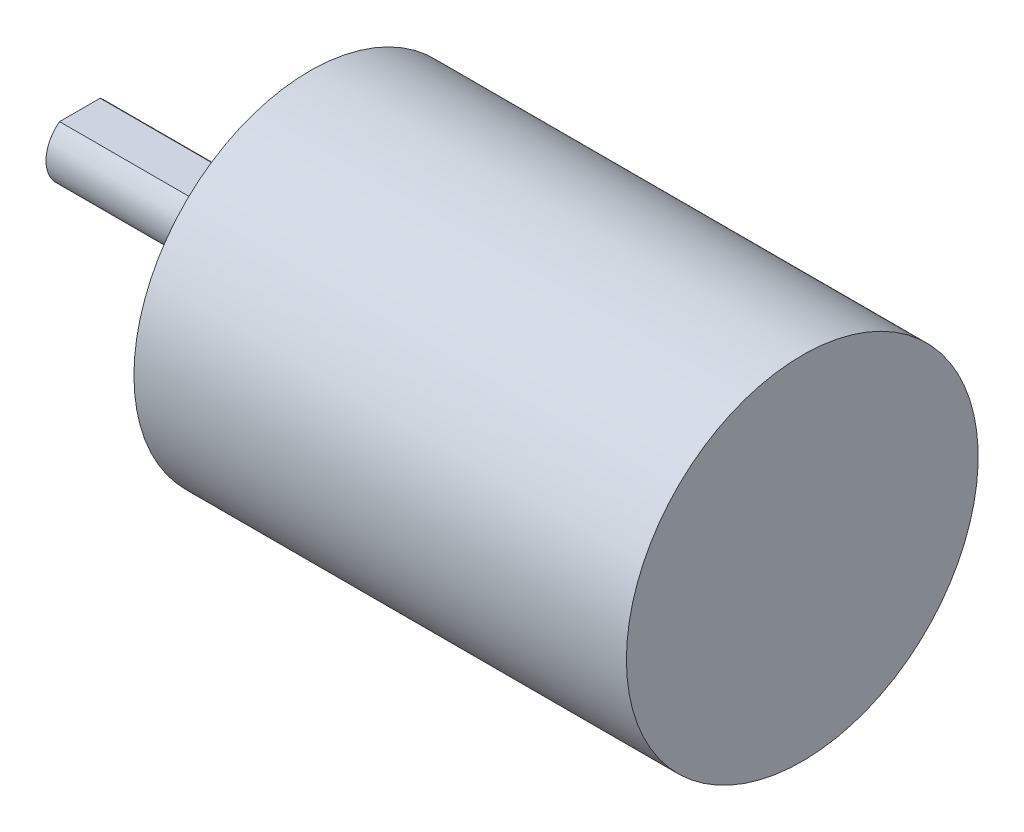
ISO-10303-21;
HEADER;
FILE_DESCRIPTION(('STEP AP214'),'2;1');
FILE_NAME('part.step','',(''),(''),'','','');
FILE_SCHEMA(('AUTOMOTIVE_DESIGN { 1 0 10303 214 1 1 1 1 }'));
ENDSEC;
DATA;
#1=APPLICATION_CONTEXT('core data for automotive mechanical design processes');
#2=APPLICATION_PROTOCOL_DEFINITION('international standard','automotive_design',2000,#1);
#3=PRODUCT_CONTEXT('',#1,'mechanical');
#4=PRODUCT('Part','Part','',(#3));
#5=PRODUCT_RELATED_PRODUCT_CATEGORY('part','',(#4));
#6=PRODUCT_DEFINITION_FORMATION('','',#4);
#7=PRODUCT_DEFINITION_CONTEXT('part definition',#1,'design');
#8=PRODUCT_DEFINITION('design','',#6,#7);
#9=PRODUCT_DEFINITION_SHAPE('','',#8);
#10=(LENGTH_UNIT() NAMED_UNIT(*) SI_UNIT(.MILLI.,.METRE.));
#11=(NAMED_UNIT(*) PLANE_ANGLE_UNIT() SI_UNIT($,.RADIAN.));
#12=(NAMED_UNIT(*) SI_UNIT($,.STERADIAN.) SOLID_ANGLE_UNIT());
#13=UNCERTAINTY_MEASURE_WITH_UNIT(LENGTH_MEASURE(1.E-05),#10,'distance_accuracy_value','');
#14=(GEOMETRIC_REPRESENTATION_CONTEXT(3) GLOBAL_UNCERTAINTY_ASSIGNED_CONTEXT((#13)) GLOBAL_UNIT_ASSIGNED_CONTEXT((#10,
#11,#12)) REPRESENTATION_CONTEXT('',''));
#15=CARTESIAN_POINT('',(0.,0.,0.));
#16=DIRECTION('',(0.,0.,1.));
#17=DIRECTION('',(1.,0.,0.));
#18=AXIS2_PLACEMENT_3D('',#15,#16,#17);
#19=CARTESIAN_POINT('',(53.4,13.,0.));
#20=DIRECTION('',(-1.,0.,0.));
#21=DIRECTION('',(0.,0.,1.));
#22=AXIS2_PLACEMENT_3D('',#19,#20,#21);
#23=PLANE('',#22);
#24=CARTESIAN_POINT('',(53.4,0.,0.));
#25=DIRECTION('',(-1.,0.,0.));
#26=DIRECTION('',(0.,0.,1.));
#27=AXIS2_PLACEMENT_3D('',#24,#25,#26);
#28=CIRCLE('',#27,13.);
#29=CARTESIAN_POINT('',(53.4,0.,13.));
#30=VERTEX_POINT('',#29);
#31=EDGE_CURVE('E11',#30,#30,#28,.T.);
#32=ORIENTED_EDGE('',*,*,#31,.F.);
#33=EDGE_LOOP('',(#32));
#34=FACE_BOUND('',#33,.T.);
#35=ADVANCED_FACE('F42',(#34),#23,.F.);
#36=CARTESIAN_POINT('',(0.,0.,0.));
#37=DIRECTION('',(-1.,0.,0.));
#38=DIRECTION('',(0.,0.,1.));
#39=AXIS2_PLACEMENT_3D('',#36,#37,#38);
#40=CYLINDRICAL_SURFACE('',#39,13.);
#41=CARTESIAN_POINT('',(17.,0.,0.));
#42=DIRECTION('',(-1.,0.,0.));
#43=DIRECTION('',(0.,0.,1.));
#44=AXIS2_PLACEMENT_3D('',#41,#42,#43);
#45=CIRCLE('',#44,13.);
#46=CARTESIAN_POINT('',(17.,0.,13.));
#47=VERTEX_POINT('',#46);
#48=EDGE_CURVE('E49',#47,#47,#45,.T.);
#49=ORIENTED_EDGE('',*,*,#48,.F.);
#50=EDGE_LOOP('',(#49));
#51=FACE_BOUND('',#50,.T.);
#52=ORIENTED_EDGE('',*,*,#31,.T.);
#53=EDGE_LOOP('',(#52));
#54=FACE_BOUND('',#53,.T.);
#55=ADVANCED_FACE('F154',(#51,#54),#40,.T.);
#56=CARTESIAN_POINT('',(17.,6.5,0.));
#57=DIRECTION('',(1.,0.,0.));
#58=DIRECTION('',(0.,0.,-1.));
#59=AXIS2_PLACEMENT_3D('',#56,#57,#58);
#60=PLANE('',#59);
#61=CARTESIAN_POINT('',(17.,-10.,1.04744500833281E-13));
#62=DIRECTION('',(-1.,0.,0.));
#63=DIRECTION('',(0.,0.,1.));
#64=AXIS2_PLACEMENT_3D('',#61,#62,#63);
#65=CIRCLE('',#64,1.5);
#66=CARTESIAN_POINT('',(17.,-10.,1.5000000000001));
#67=VERTEX_POINT('',#66);
#68=EDGE_CURVE('E92',#67,#67,#65,.T.);
#69=ORIENTED_EDGE('',*,*,#68,.F.);
#70=EDGE_LOOP('',(#69));
#71=FACE_BOUND('',#70,.T.);
#72=CARTESIAN_POINT('',(17.,0.,-10.));
#73=DIRECTION('',(-1.,0.,0.));
#74=DIRECTION('',(0.,0.,1.));
#75=AXIS2_PLACEMENT_3D('',#72,#73,#74);
#76=CIRCLE('',#75,1.5);
#77=CARTESIAN_POINT('',(17.,0.,-8.5));
#78=VERTEX_POINT('',#77);
#79=EDGE_CURVE('E103',#78,#78,#76,.T.);
#80=ORIENTED_EDGE('',*,*,#79,.F.);
#81=EDGE_LOOP('',(#80));
#82=FACE_BOUND('',#81,.T.);
#83=CARTESIAN_POINT('',(17.,10.,0.));
#84=DIRECTION('',(-1.,0.,0.));
#85=DIRECTION('',(0.,0.,1.));
#86=AXIS2_PLACEMENT_3D('',#83,#84,#85);
#87=CIRCLE('',#86,1.5);
#88=CARTESIAN_POINT('',(17.,10.,1.49999999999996));
#89=VERTEX_POINT('',#88);
#90=EDGE_CURVE('E112',#89,#89,#87,.T.);
#91=ORIENTED_EDGE('',*,*,#90,.F.);
#92=EDGE_LOOP('',(#91));
#93=FACE_BOUND('',#92,.T.);
#94=CARTESIAN_POINT('',(17.,0.,10.));
#95=DIRECTION('',(-1.,0.,0.));
#96=DIRECTION('',(0.,0.,1.));
#97=AXIS2_PLACEMENT_3D('',#94,#95,#96);
#98=CIRCLE('',#97,1.5);
#99=CARTESIAN_POINT('',(17.,0.,11.5));
#100=VERTEX_POINT('',#99);
#101=EDGE_CURVE('E121',#100,#100,#98,.T.);
#102=ORIENTED_EDGE('',*,*,#101,.F.);
#103=EDGE_LOOP('',(#102));
#104=FACE_BOUND('',#103,.T.);
#105=CARTESIAN_POINT('',(17.,0.,0.));
#106=DIRECTION('',(-1.,0.,0.));
#107=DIRECTION('',(0.,0.,1.));
#108=AXIS2_PLACEMENT_3D('',#105,#106,#107);
#109=CIRCLE('',#108,6.5);
#110=CARTESIAN_POINT('',(17.,0.,6.5));
#111=VERTEX_POINT('',#110);
#112=EDGE_CURVE('E147',#111,#111,#109,.T.);
#113=ORIENTED_EDGE('',*,*,#112,.F.);
#114=EDGE_LOOP('',(#113));
#115=FACE_BOUND('',#114,.T.);
#116=ORIENTED_EDGE('',*,*,#48,.T.);
#117=EDGE_LOOP('',(#116));
#118=FACE_BOUND('',#117,.T.);
#119=ADVANCED_FACE('F152',(#71,#82,#93,#104,#115,#118),#60,.F.);
#120=CARTESIAN_POINT('',(0.,0.,0.));
#121=DIRECTION('',(-1.,0.,0.));
#122=DIRECTION('',(0.,0.,1.));
#123=AXIS2_PLACEMENT_3D('',#120,#121,#122);
#124=CYLINDRICAL_SURFACE('',#123,6.5);
#125=CARTESIAN_POINT('',(15.,0.,0.));
#126=DIRECTION('',(-1.,0.,0.));
#127=DIRECTION('',(0.,0.,1.));
#128=AXIS2_PLACEMENT_3D('',#125,#126,#127);
#129=CIRCLE('',#128,6.5);
#130=CARTESIAN_POINT('',(15.,0.,6.5));
#131=VERTEX_POINT('',#130);
#132=EDGE_CURVE('E144',#131,#131,#129,.T.);
#133=ORIENTED_EDGE('',*,*,#132,.F.);
#134=EDGE_LOOP('',(#133));
#135=FACE_BOUND('',#134,.T.);
#136=ORIENTED_EDGE('',*,*,#112,.T.);
#137=EDGE_LOOP('',(#136));
#138=FACE_BOUND('',#137,.T.);
#139=ADVANCED_FACE('F173',(#135,#138),#124,.T.);
#140=CARTESIAN_POINT('',(15.,3.,0.));
#141=DIRECTION('',(1.,0.,0.));
#142=DIRECTION('',(0.,0.,-1.));
#143=AXIS2_PLACEMENT_3D('',#140,#141,#142);
#144=PLANE('',#143);
#145=CARTESIAN_POINT('',(15.,0.,0.));
#146=DIRECTION('',(-1.,0.,0.));
#147=DIRECTION('',(0.,0.,1.));
#148=AXIS2_PLACEMENT_3D('',#145,#146,#147);
#149=CIRCLE('',#148,3.);
#150=CARTESIAN_POINT('',(15.,0.,3.));
#151=VERTEX_POINT('',#150);
#152=EDGE_CURVE('E141',#151,#151,#149,.T.);
#153=ORIENTED_EDGE('',*,*,#152,.F.);
#154=EDGE_LOOP('',(#153));
#155=FACE_BOUND('',#154,.T.);
#156=ORIENTED_EDGE('',*,*,#132,.T.);
#157=EDGE_LOOP('',(#156));
#158=FACE_BOUND('',#157,.T.);
#159=ADVANCED_FACE('F182',(#155,#158),#144,.F.);
#160=CARTESIAN_POINT('',(0.,0.,0.));
#161=DIRECTION('',(-1.,0.,0.));
#162=DIRECTION('',(0.,0.,1.));
#163=AXIS2_PLACEMENT_3D('',#160,#161,#162);
#164=CYLINDRICAL_SURFACE('',#163,3.);
#165=CARTESIAN_POINT('',(14.5,0.,0.));
#166=DIRECTION('',(-1.,0.,0.));
#167=DIRECTION('',(0.,0.,1.));
#168=AXIS2_PLACEMENT_3D('',#165,#166,#167);
#169=CIRCLE('',#168,3.);
#170=CARTESIAN_POINT('',(14.5,0.,3.));
#171=VERTEX_POINT('',#170);
#172=EDGE_CURVE('E138',#171,#171,#169,.T.);
#173=ORIENTED_EDGE('',*,*,#172,.F.);
#174=EDGE_LOOP('',(#173));
#175=FACE_BOUND('',#174,.T.);
#176=ORIENTED_EDGE('',*,*,#152,.T.);
#177=EDGE_LOOP('',(#176));
#178=FACE_BOUND('',#177,.T.);
#179=ADVANCED_FACE('F190',(#175,#178),#164,.T.);
#180=CARTESIAN_POINT('',(14.5,2.5,0.));
#181=DIRECTION('',(1.,0.,0.));
#182=DIRECTION('',(0.,0.,-1.));
#183=AXIS2_PLACEMENT_3D('',#180,#181,#182);
#184=PLANE('',#183);
#185=CARTESIAN_POINT('',(14.5,0.,0.));
#186=DIRECTION('',(-1.,0.,0.));
#187=DIRECTION('',(0.,0.,1.));
#188=AXIS2_PLACEMENT_3D('',#185,#186,#187);
#189=CIRCLE('',#188,2.5);
#190=CARTESIAN_POINT('',(14.5,0.,2.5));
#191=VERTEX_POINT('',#190);
#192=EDGE_CURVE('E135',#191,#191,#189,.T.);
#193=ORIENTED_EDGE('',*,*,#192,.F.);
#194=EDGE_LOOP('',(#193));
#195=FACE_BOUND('',#194,.T.);
#196=ORIENTED_EDGE('',*,*,#172,.T.);
#197=EDGE_LOOP('',(#196));
#198=FACE_BOUND('',#197,.T.);
#199=ADVANCED_FACE('F198',(#195,#198),#184,.F.);
#200=CARTESIAN_POINT('',(0.,0.,0.));
#201=DIRECTION('',(-1.,0.,0.));
#202=DIRECTION('',(0.,0.,1.));
#203=AXIS2_PLACEMENT_3D('',#200,#201,#202);
#204=CYLINDRICAL_SURFACE('',#203,2.5);
#205=CARTESIAN_POINT('',(12.,0.,0.));
#206=DIRECTION('',(-1.,0.,0.));
#207=DIRECTION('',(0.,0.,1.));
#208=AXIS2_PLACEMENT_3D('',#205,#206,#207);
#209=CIRCLE('',#208,2.5);
#210=CARTESIAN_POINT('',(12.,2.,1.5));
#211=VERTEX_POINT('',#210);
#212=CARTESIAN_POINT('',(12.,2.,-1.5));
#213=VERTEX_POINT('',#212);
#214=EDGE_CURVE('E126',#211,#213,#209,.T.);
#215=ORIENTED_EDGE('',*,*,#214,.F.);
#216=DIRECTION('',(-1.,0.,0.));
#217=VECTOR('',#216,1.);
#218=CARTESIAN_POINT('',(12.,2.,1.5));
#219=LINE('',#218,#217);
#220=CARTESIAN_POINT('',(0.,2.,1.5));
#221=VERTEX_POINT('',#220);
#222=EDGE_CURVE('E61',#211,#221,#219,.T.);
#223=ORIENTED_EDGE('',*,*,#222,.T.);
#224=CARTESIAN_POINT('',(0.,0.,0.));
#225=DIRECTION('',(-1.,0.,0.));
#226=DIRECTION('',(0.,0.,1.));
#227=AXIS2_PLACEMENT_3D('',#224,#225,#226);
#228=CIRCLE('',#227,2.5);
#229=CARTESIAN_POINT('',(0.,2.,-1.5));
#230=VERTEX_POINT('',#229);
#231=EDGE_CURVE('E131',#230,#221,#228,.T.);
#232=ORIENTED_EDGE('',*,*,#231,.F.);
#233=DIRECTION('',(-1.,0.,0.));
#234=VECTOR('',#233,1.);
#235=CARTESIAN_POINT('',(12.,2.,-1.5));
#236=LINE('',#235,#234);
#237=EDGE_CURVE('E56',#213,#230,#236,.T.);
#238=ORIENTED_EDGE('',*,*,#237,.F.);
#239=EDGE_LOOP('',(#215,#223,#232,#238));
#240=FACE_BOUND('',#239,.T.);
#241=ORIENTED_EDGE('',*,*,#192,.T.);
#242=EDGE_LOOP('',(#241));
#243=FACE_BOUND('',#242,.T.);
#244=ADVANCED_FACE('F206',(#240,#243),#204,.T.);
#245=CARTESIAN_POINT('',(0.,0.,0.));
#246=DIRECTION('',(1.,0.,0.));
#247=DIRECTION('',(0.,0.,-1.));
#248=AXIS2_PLACEMENT_3D('',#245,#246,#247);
#249=PLANE('',#248);
#250=ORIENTED_EDGE('',*,*,#231,.T.);
#251=DIRECTION('',(0.,0.,1.));
#252=VECTOR('',#251,1.);
#253=CARTESIAN_POINT('',(0.,2.,-1.5));
#254=LINE('',#253,#252);
#255=EDGE_CURVE('E124',#230,#221,#254,.T.);
#256=ORIENTED_EDGE('',*,*,#255,.F.);
#257=EDGE_LOOP('',(#250,#256));
#258=FACE_BOUND('',#257,.T.);
#259=ADVANCED_FACE('F214',(#258),#249,.F.);
#260=CARTESIAN_POINT('',(12.,2.,-1.5));
#261=DIRECTION('',(0.,-1.,0.));
#262=DIRECTION('',(0.,0.,-1.));
#263=AXIS2_PLACEMENT_3D('',#260,#261,#262);
#264=PLANE('',#263);
#265=ORIENTED_EDGE('',*,*,#255,.T.);
#266=ORIENTED_EDGE('',*,*,#222,.F.);
#267=DIRECTION('',(0.,0.,1.));
#268=VECTOR('',#267,1.);
#269=CARTESIAN_POINT('',(12.,2.,-1.5));
#270=LINE('',#269,#268);
#271=EDGE_CURVE('E128',#213,#211,#270,.T.);
#272=ORIENTED_EDGE('',*,*,#271,.F.);
#273=ORIENTED_EDGE('',*,*,#237,.T.);
#274=EDGE_LOOP('',(#265,#266,#272,#273));
#275=FACE_BOUND('',#274,.T.);
#276=ADVANCED_FACE('F222',(#275),#264,.F.);
#277=CARTESIAN_POINT('',(12.,0.,0.));
#278=DIRECTION('',(-1.,0.,0.));
#279=DIRECTION('',(0.,0.,1.));
#280=AXIS2_PLACEMENT_3D('',#277,#278,#279);
#281=PLANE('',#280);
#282=ORIENTED_EDGE('',*,*,#214,.T.);
#283=ORIENTED_EDGE('',*,*,#271,.T.);
#284=EDGE_LOOP('',(#282,#283));
#285=FACE_BOUND('',#284,.T.);
#286=ADVANCED_FACE('F230',(#285),#281,.T.);
#287=CARTESIAN_POINT('',(17.,0.,10.));
#288=DIRECTION('',(-1.,0.,0.));
#289=DIRECTION('',(0.,0.,1.));
#290=AXIS2_PLACEMENT_3D('',#287,#288,#289);
#291=CONICAL_SURFACE('',#290,1.5,0.785398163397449);
#292=CARTESIAN_POINT('',(17.25,0.,10.));
#293=DIRECTION('',(-1.,0.,0.));
#294=DIRECTION('',(0.,0.,1.));
#295=AXIS2_PLACEMENT_3D('',#292,#293,#294);
#296=CIRCLE('',#295,1.25);
#297=CARTESIAN_POINT('',(17.25,0.,11.25));
#298=VERTEX_POINT('',#297);
#299=EDGE_CURVE('E118',#298,#298,#296,.T.);
#300=ORIENTED_EDGE('',*,*,#299,.F.);
#301=EDGE_LOOP('',(#300));
#302=FACE_BOUND('',#301,.T.);
#303=ORIENTED_EDGE('',*,*,#101,.T.);
#304=EDGE_LOOP('',(#303));
#305=FACE_BOUND('',#304,.T.);
#306=ADVANCED_FACE('F237',(#302,#305),#291,.F.);
#307=CARTESIAN_POINT('',(17.,0.,10.));
#308=DIRECTION('',(-1.,0.,0.));
#309=DIRECTION('',(0.,0.,1.));
#310=AXIS2_PLACEMENT_3D('',#307,#308,#309);
#311=CYLINDRICAL_SURFACE('',#310,1.25);
#312=CARTESIAN_POINT('',(22.5,0.,10.));
#313=DIRECTION('',(-1.,0.,0.));
#314=DIRECTION('',(0.,0.,1.));
#315=AXIS2_PLACEMENT_3D('',#312,#313,#314);
#316=CIRCLE('',#315,1.25);
#317=CARTESIAN_POINT('',(22.5,0.,11.25));
#318=VERTEX_POINT('',#317);
#319=EDGE_CURVE('E115',#318,#318,#316,.T.);
#320=ORIENTED_EDGE('',*,*,#319,.F.);
#321=EDGE_LOOP('',(#320));
#322=FACE_BOUND('',#321,.T.);
#323=ORIENTED_EDGE('',*,*,#299,.T.);
#324=EDGE_LOOP('',(#323));
#325=FACE_BOUND('',#324,.T.);
#326=ADVANCED_FACE('F245',(#322,#325),#311,.F.);
#327=CARTESIAN_POINT('',(22.5,0.,10.));
#328=DIRECTION('',(-1.,0.,0.));
#329=DIRECTION('',(0.,0.,1.));
#330=AXIS2_PLACEMENT_3D('',#327,#328,#329);
#331=CONICAL_SURFACE('',#330,1.25,1.0471975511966);
#332=CARTESIAN_POINT('',(23.221687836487,0.,10.));
#333=VERTEX_POINT('',#332);
#334=VERTEX_LOOP('',#333);
#335=FACE_BOUND('',#334,.T.);
#336=ORIENTED_EDGE('',*,*,#319,.T.);
#337=EDGE_LOOP('',(#336));
#338=FACE_BOUND('',#337,.T.);
#339=ADVANCED_FACE('F254',(#335,#338),#331,.F.);
#340=CARTESIAN_POINT('',(17.,10.,0.));
#341=DIRECTION('',(-1.,0.,0.));
#342=DIRECTION('',(0.,0.,1.));
#343=AXIS2_PLACEMENT_3D('',#340,#341,#342);
#344=CONICAL_SURFACE('',#343,1.5,0.785398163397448);
#345=CARTESIAN_POINT('',(17.25,10.,0.));
#346=DIRECTION('',(-1.,0.,0.));
#347=DIRECTION('',(0.,0.,1.));
#348=AXIS2_PLACEMENT_3D('',#345,#346,#347);
#349=CIRCLE('',#348,1.25);
#350=CARTESIAN_POINT('',(17.25,10.,1.24999999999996));
#351=VERTEX_POINT('',#350);
#352=EDGE_CURVE('E109',#351,#351,#349,.T.);
#353=ORIENTED_EDGE('',*,*,#352,.F.);
#354=EDGE_LOOP('',(#353));
#355=FACE_BOUND('',#354,.T.);
#356=ORIENTED_EDGE('',*,*,#90,.T.);
#357=EDGE_LOOP('',(#356));
#358=FACE_BOUND('',#357,.T.);
#359=ADVANCED_FACE('F261',(#355,#358),#344,.F.);
#360=CARTESIAN_POINT('',(17.,10.,0.));
#361=DIRECTION('',(-1.,0.,0.));
#362=DIRECTION('',(0.,0.,1.));
#363=AXIS2_PLACEMENT_3D('',#360,#361,#362);
#364=CYLINDRICAL_SURFACE('',#363,1.25);
#365=CARTESIAN_POINT('',(22.5,10.,0.));
#366=DIRECTION('',(-1.,0.,0.));
#367=DIRECTION('',(0.,0.,1.));
#368=AXIS2_PLACEMENT_3D('',#365,#366,#367);
#369=CIRCLE('',#368,1.25);
#370=CARTESIAN_POINT('',(22.5,10.,1.24999999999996));
#371=VERTEX_POINT('',#370);
#372=EDGE_CURVE('E106',#371,#371,#369,.T.);
#373=ORIENTED_EDGE('',*,*,#372,.F.);
#374=EDGE_LOOP('',(#373));
#375=FACE_BOUND('',#374,.T.);
#376=ORIENTED_EDGE('',*,*,#352,.T.);
#377=EDGE_LOOP('',(#376));
#378=FACE_BOUND('',#377,.T.);
#379=ADVANCED_FACE('F268',(#375,#378),#364,.F.);
#380=CARTESIAN_POINT('',(22.5,10.,0.));
#381=DIRECTION('',(-1.,0.,0.));
#382=DIRECTION('',(0.,0.,1.));
#383=AXIS2_PLACEMENT_3D('',#380,#381,#382);
#384=CONICAL_SURFACE('',#383,1.25,1.0471975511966);
#385=CARTESIAN_POINT('',(23.221687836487,10.,0.));
#386=VERTEX_POINT('',#385);
#387=VERTEX_LOOP('',#386);
#388=FACE_BOUND('',#387,.T.);
#389=ORIENTED_EDGE('',*,*,#372,.T.);
#390=EDGE_LOOP('',(#389));
#391=FACE_BOUND('',#390,.T.);
#392=ADVANCED_FACE('F276',(#388,#391),#384,.F.);
#393=CARTESIAN_POINT('',(17.,0.,-10.));
#394=DIRECTION('',(-1.,0.,0.));
#395=DIRECTION('',(0.,0.,1.));
#396=AXIS2_PLACEMENT_3D('',#393,#394,#395);
#397=CONICAL_SURFACE('',#396,1.5,0.785398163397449);
#398=CARTESIAN_POINT('',(17.25,0.,-10.));
#399=DIRECTION('',(-1.,0.,0.));
#400=DIRECTION('',(0.,0.,1.));
#401=AXIS2_PLACEMENT_3D('',#398,#399,#400);
#402=CIRCLE('',#401,1.25);
#403=CARTESIAN_POINT('',(17.25,0.,-8.75));
#404=VERTEX_POINT('',#403);
#405=EDGE_CURVE('E100',#404,#404,#402,.T.);
#406=ORIENTED_EDGE('',*,*,#405,.F.);
#407=EDGE_LOOP('',(#406));
#408=FACE_BOUND('',#407,.T.);
#409=ORIENTED_EDGE('',*,*,#79,.T.);
#410=EDGE_LOOP('',(#409));
#411=FACE_BOUND('',#410,.T.);
#412=ADVANCED_FACE('F284',(#408,#411),#397,.F.);
#413=CARTESIAN_POINT('',(17.,0.,-10.));
#414=DIRECTION('',(-1.,0.,0.));
#415=DIRECTION('',(0.,0.,1.));
#416=AXIS2_PLACEMENT_3D('',#413,#414,#415);
#417=CYLINDRICAL_SURFACE('',#416,1.25);
#418=CARTESIAN_POINT('',(22.5,0.,-10.));
#419=DIRECTION('',(-1.,0.,0.));
#420=DIRECTION('',(0.,0.,1.));
#421=AXIS2_PLACEMENT_3D('',#418,#419,#420);
#422=CIRCLE('',#421,1.25);
#423=CARTESIAN_POINT('',(22.5,0.,-8.75));
#424=VERTEX_POINT('',#423);
#425=EDGE_CURVE('E97',#424,#424,#422,.T.);
#426=ORIENTED_EDGE('',*,*,#425,.F.);
#427=EDGE_LOOP('',(#426));
#428=FACE_BOUND('',#427,.T.);
#429=ORIENTED_EDGE('',*,*,#405,.T.);
#430=EDGE_LOOP('',(#429));
#431=FACE_BOUND('',#430,.T.);
#432=ADVANCED_FACE('F292',(#428,#431),#417,.F.);
#433=CARTESIAN_POINT('',(22.5,0.,-10.));
#434=DIRECTION('',(-1.,0.,0.));
#435=DIRECTION('',(0.,0.,1.));
#436=AXIS2_PLACEMENT_3D('',#433,#434,#435);
#437=CONICAL_SURFACE('',#436,1.25,1.0471975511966);
#438=CARTESIAN_POINT('',(23.221687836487,0.,-10.));
#439=VERTEX_POINT('',#438);
#440=VERTEX_LOOP('',#439);
#441=FACE_BOUND('',#440,.T.);
#442=ORIENTED_EDGE('',*,*,#425,.T.);
#443=EDGE_LOOP('',(#442));
#444=FACE_BOUND('',#443,.T.);
#445=ADVANCED_FACE('F300',(#441,#444),#437,.F.);
#446=CARTESIAN_POINT('',(17.,-10.,1.04744500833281E-13));
#447=DIRECTION('',(-1.,0.,0.));
#448=DIRECTION('',(0.,0.,1.));
#449=AXIS2_PLACEMENT_3D('',#446,#447,#448);
#450=CONICAL_SURFACE('',#449,1.5,0.785398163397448);
#451=CARTESIAN_POINT('',(17.25,-10.,1.04744500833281E-13));
#452=DIRECTION('',(-1.,0.,0.));
#453=DIRECTION('',(0.,0.,1.));
#454=AXIS2_PLACEMENT_3D('',#451,#452,#453);
#455=CIRCLE('',#454,1.25);
#456=CARTESIAN_POINT('',(17.25,-10.,1.2500000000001));
#457=VERTEX_POINT('',#456);
#458=EDGE_CURVE('E89',#457,#457,#455,.T.);
#459=ORIENTED_EDGE('',*,*,#458,.F.);
#460=EDGE_LOOP('',(#459));
#461=FACE_BOUND('',#460,.T.);
#462=ORIENTED_EDGE('',*,*,#68,.T.);
#463=EDGE_LOOP('',(#462));
#464=FACE_BOUND('',#463,.T.);
#465=ADVANCED_FACE('F308',(#461,#464),#450,.F.);
#466=CARTESIAN_POINT('',(17.,-10.,1.04744500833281E-13));
#467=DIRECTION('',(-1.,0.,0.));
#468=DIRECTION('',(0.,0.,1.));
#469=AXIS2_PLACEMENT_3D('',#466,#467,#468);
#470=CYLINDRICAL_SURFACE('',#469,1.25);
#471=CARTESIAN_POINT('',(22.5,-10.,1.04744500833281E-13));
#472=DIRECTION('',(-1.,0.,0.));
#473=DIRECTION('',(0.,0.,1.));
#474=AXIS2_PLACEMENT_3D('',#471,#472,#473);
#475=CIRCLE('',#474,1.25);
#476=CARTESIAN_POINT('',(22.5,-10.,1.2500000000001));
#477=VERTEX_POINT('',#476);
#478=EDGE_CURVE('E87',#477,#477,#475,.T.);
#479=ORIENTED_EDGE('',*,*,#478,.F.);
#480=EDGE_LOOP('',(#479));
#481=FACE_BOUND('',#480,.T.);
#482=ORIENTED_EDGE('',*,*,#458,.T.);
#483=EDGE_LOOP('',(#482));
#484=FACE_BOUND('',#483,.T.);
#485=ADVANCED_FACE('F83',(#481,#484),#470,.F.);
#486=CARTESIAN_POINT('',(22.5,-10.,1.04744500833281E-13));
#487=DIRECTION('',(-1.,0.,0.));
#488=DIRECTION('',(0.,0.,1.));
#489=AXIS2_PLACEMENT_3D('',#486,#487,#488);
#490=CONICAL_SURFACE('',#489,1.25,1.0471975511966);
#491=CARTESIAN_POINT('',(23.221687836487,-10.,1.04744500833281E-13));
#492=VERTEX_POINT('',#491);
#493=VERTEX_LOOP('',#492);
#494=FACE_BOUND('',#493,.T.);
#495=ORIENTED_EDGE('',*,*,#478,.T.);
#496=EDGE_LOOP('',(#495));
#497=FACE_BOUND('',#496,.T.);
#498=ADVANCED_FACE('F80',(#494,#497),#490,.F.);
#499=CLOSED_SHELL('',(#35,#55,#119,#139,#159,#179,#199,#244,#259,#276,#286,#306,#326,#339,#359,
#379,#392,#412,#432,#445,#465,#485,#498));
#500=MANIFOLD_SOLID_BREP('B2',#499);
#501=ADVANCED_BREP_SHAPE_REPRESENTATION('',(#18,#500),#14);
#502=SHAPE_DEFINITION_REPRESENTATION(#9,#501);
ENDSEC;
END-ISO-10303-21;
